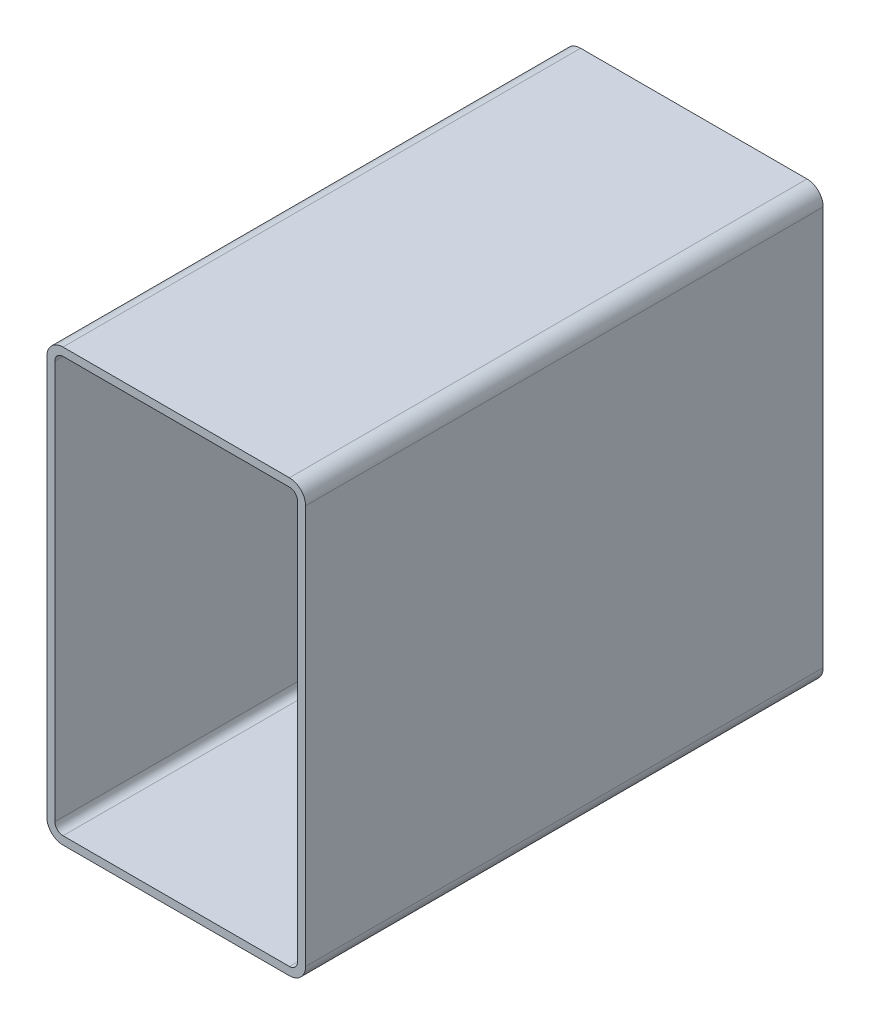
ISO-10303-21;
HEADER;
FILE_DESCRIPTION(('STEP AP214'),'2;1');
FILE_NAME('part.step','',(''),(''),'','','');
FILE_SCHEMA(('AUTOMOTIVE_DESIGN { 1 0 10303 214 1 1 1 1 }'));
ENDSEC;
DATA;
#1=APPLICATION_CONTEXT('core data for automotive mechanical design processes');
#2=APPLICATION_PROTOCOL_DEFINITION('international standard','automotive_design',2000,#1);
#3=PRODUCT_CONTEXT('',#1,'mechanical');
#4=PRODUCT('Part','Part','',(#3));
#5=PRODUCT_RELATED_PRODUCT_CATEGORY('part','',(#4));
#6=PRODUCT_DEFINITION_FORMATION('','',#4);
#7=PRODUCT_DEFINITION_CONTEXT('part definition',#1,'design');
#8=PRODUCT_DEFINITION('design','',#6,#7);
#9=PRODUCT_DEFINITION_SHAPE('','',#8);
#10=(LENGTH_UNIT() NAMED_UNIT(*) SI_UNIT(.MILLI.,.METRE.));
#11=(NAMED_UNIT(*) PLANE_ANGLE_UNIT() SI_UNIT($,.RADIAN.));
#12=(NAMED_UNIT(*) SI_UNIT($,.STERADIAN.) SOLID_ANGLE_UNIT());
#13=UNCERTAINTY_MEASURE_WITH_UNIT(LENGTH_MEASURE(1.E-05),#10,'distance_accuracy_value','');
#14=(GEOMETRIC_REPRESENTATION_CONTEXT(3) GLOBAL_UNCERTAINTY_ASSIGNED_CONTEXT((#13)) GLOBAL_UNIT_ASSIGNED_CONTEXT((#10,
#11,#12)) REPRESENTATION_CONTEXT('',''));
#15=CARTESIAN_POINT('',(0.,0.,0.));
#16=DIRECTION('',(0.,0.,1.));
#17=DIRECTION('',(1.,0.,0.));
#18=AXIS2_PLACEMENT_3D('',#15,#16,#17);
#19=CARTESIAN_POINT('',(9.57230139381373,246.395313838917,304.8));
#20=DIRECTION('',(0.,0.,1.));
#21=DIRECTION('',(1.,0.,0.));
#22=AXIS2_PLACEMENT_3D('',#19,#20,#21);
#23=PLANE('',#22);
#24=CARTESIAN_POINT('',(9.57230139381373,246.395313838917,304.8));
#25=DIRECTION('',(0.,0.,1.));
#26=DIRECTION('',(1.,0.,0.));
#27=AXIS2_PLACEMENT_3D('',#24,#25,#26);
#28=CIRCLE('',#27,9.52500000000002);
#29=CARTESIAN_POINT('',(9.57230139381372,255.920313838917,304.8));
#30=VERTEX_POINT('',#29);
#31=CARTESIAN_POINT('',(0.0473013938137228,246.395313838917,304.8));
#32=VERTEX_POINT('',#31);
#33=EDGE_CURVE('E211',#30,#32,#28,.T.);
#34=ORIENTED_EDGE('',*,*,#33,.T.);
#35=DIRECTION('',(0.,-1.,0.));
#36=VECTOR('',#35,1.);
#37=CARTESIAN_POINT('',(0.0473013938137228,11.4453138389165,304.8));
#38=LINE('',#37,#36);
#39=CARTESIAN_POINT('',(0.0473013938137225,11.4453138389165,304.8));
#40=VERTEX_POINT('',#39);
#41=EDGE_CURVE('E214',#32,#40,#38,.T.);
#42=ORIENTED_EDGE('',*,*,#41,.T.);
#43=CARTESIAN_POINT('',(9.57230139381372,11.4453138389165,304.8));
#44=DIRECTION('',(0.,0.,1.));
#45=DIRECTION('',(1.,0.,0.));
#46=AXIS2_PLACEMENT_3D('',#43,#44,#45);
#47=CIRCLE('',#46,9.525);
#48=CARTESIAN_POINT('',(9.57230139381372,1.92031383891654,304.8));
#49=VERTEX_POINT('',#48);
#50=EDGE_CURVE('E217',#40,#49,#47,.T.);
#51=ORIENTED_EDGE('',*,*,#50,.T.);
#52=DIRECTION('',(1.,0.,0.));
#53=VECTOR('',#52,1.);
#54=CARTESIAN_POINT('',(142.922301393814,1.92031383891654,304.8));
#55=LINE('',#54,#53);
#56=CARTESIAN_POINT('',(142.922301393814,1.92031383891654,304.8));
#57=VERTEX_POINT('',#56);
#58=EDGE_CURVE('E219',#49,#57,#55,.T.);
#59=ORIENTED_EDGE('',*,*,#58,.T.);
#60=CARTESIAN_POINT('',(142.922301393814,11.4453138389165,304.8));
#61=DIRECTION('',(0.,0.,1.));
#62=DIRECTION('',(1.,0.,0.));
#63=AXIS2_PLACEMENT_3D('',#60,#61,#62);
#64=CIRCLE('',#63,9.52500000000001);
#65=CARTESIAN_POINT('',(152.447301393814,11.4453138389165,304.8));
#66=VERTEX_POINT('',#65);
#67=EDGE_CURVE('E221',#57,#66,#64,.T.);
#68=ORIENTED_EDGE('',*,*,#67,.T.);
#69=DIRECTION('',(0.,1.,0.));
#70=VECTOR('',#69,1.);
#71=CARTESIAN_POINT('',(152.447301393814,246.395313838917,304.8));
#72=LINE('',#71,#70);
#73=CARTESIAN_POINT('',(152.447301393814,246.395313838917,304.8));
#74=VERTEX_POINT('',#73);
#75=EDGE_CURVE('E223',#66,#74,#72,.T.);
#76=ORIENTED_EDGE('',*,*,#75,.T.);
#77=CARTESIAN_POINT('',(142.922301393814,246.395313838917,304.8));
#78=DIRECTION('',(0.,0.,1.));
#79=DIRECTION('',(1.,0.,0.));
#80=AXIS2_PLACEMENT_3D('',#77,#78,#79);
#81=CIRCLE('',#80,9.52500000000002);
#82=CARTESIAN_POINT('',(142.922301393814,255.920313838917,304.8));
#83=VERTEX_POINT('',#82);
#84=EDGE_CURVE('E225',#74,#83,#81,.T.);
#85=ORIENTED_EDGE('',*,*,#84,.T.);
#86=DIRECTION('',(-1.,0.,0.));
#87=VECTOR('',#86,1.);
#88=CARTESIAN_POINT('',(9.57230139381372,255.920313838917,304.8));
#89=LINE('',#88,#87);
#90=EDGE_CURVE('E227',#83,#30,#89,.T.);
#91=ORIENTED_EDGE('',*,*,#90,.T.);
#92=EDGE_LOOP('',(#34,#42,#51,#59,#68,#76,#85,#91));
#93=FACE_BOUND('',#92,.T.);
#94=DIRECTION('',(0.,-1.,0.));
#95=VECTOR('',#94,1.);
#96=CARTESIAN_POINT('',(4.80980139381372,11.4453138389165,304.8));
#97=LINE('',#96,#95);
#98=CARTESIAN_POINT('',(4.80980139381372,246.395313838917,304.8));
#99=VERTEX_POINT('',#98);
#100=CARTESIAN_POINT('',(4.80980139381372,11.4453138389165,304.8));
#101=VERTEX_POINT('',#100);
#102=EDGE_CURVE('E154',#99,#101,#97,.T.);
#103=ORIENTED_EDGE('',*,*,#102,.F.);
#104=CARTESIAN_POINT('',(9.57230139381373,246.395313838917,304.8));
#105=DIRECTION('',(0.,0.,1.));
#106=DIRECTION('',(1.,0.,0.));
#107=AXIS2_PLACEMENT_3D('',#104,#105,#106);
#108=CIRCLE('',#107,4.76250000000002);
#109=CARTESIAN_POINT('',(9.57230139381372,251.157813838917,304.8));
#110=VERTEX_POINT('',#109);
#111=EDGE_CURVE('E146',#110,#99,#108,.T.);
#112=ORIENTED_EDGE('',*,*,#111,.F.);
#113=DIRECTION('',(-1.,0.,0.));
#114=VECTOR('',#113,1.);
#115=CARTESIAN_POINT('',(9.57230139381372,251.157813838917,304.8));
#116=LINE('',#115,#114);
#117=CARTESIAN_POINT('',(142.922301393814,251.157813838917,304.8));
#118=VERTEX_POINT('',#117);
#119=EDGE_CURVE('E179',#118,#110,#116,.T.);
#120=ORIENTED_EDGE('',*,*,#119,.F.);
#121=CARTESIAN_POINT('',(142.922301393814,246.395313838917,304.8));
#122=DIRECTION('',(0.,0.,1.));
#123=DIRECTION('',(1.,0.,0.));
#124=AXIS2_PLACEMENT_3D('',#121,#122,#123);
#125=CIRCLE('',#124,4.76250000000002);
#126=CARTESIAN_POINT('',(147.684801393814,246.395313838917,304.8));
#127=VERTEX_POINT('',#126);
#128=EDGE_CURVE('E177',#127,#118,#125,.T.);
#129=ORIENTED_EDGE('',*,*,#128,.F.);
#130=DIRECTION('',(0.,1.,0.));
#131=VECTOR('',#130,1.);
#132=CARTESIAN_POINT('',(147.684801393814,246.395313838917,304.8));
#133=LINE('',#132,#131);
#134=CARTESIAN_POINT('',(147.684801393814,11.4453138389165,304.8));
#135=VERTEX_POINT('',#134);
#136=EDGE_CURVE('E175',#135,#127,#133,.T.);
#137=ORIENTED_EDGE('',*,*,#136,.F.);
#138=CARTESIAN_POINT('',(142.922301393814,11.4453138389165,304.8));
#139=DIRECTION('',(0.,0.,1.));
#140=DIRECTION('',(1.,0.,0.));
#141=AXIS2_PLACEMENT_3D('',#138,#139,#140);
#142=CIRCLE('',#141,4.7625);
#143=CARTESIAN_POINT('',(142.922301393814,6.68281383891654,304.8));
#144=VERTEX_POINT('',#143);
#145=EDGE_CURVE('E173',#144,#135,#142,.T.);
#146=ORIENTED_EDGE('',*,*,#145,.F.);
#147=DIRECTION('',(1.,0.,0.));
#148=VECTOR('',#147,1.);
#149=CARTESIAN_POINT('',(142.922301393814,6.68281383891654,304.8));
#150=LINE('',#149,#148);
#151=CARTESIAN_POINT('',(9.57230139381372,6.68281383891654,304.8));
#152=VERTEX_POINT('',#151);
#153=EDGE_CURVE('E169',#152,#144,#150,.T.);
#154=ORIENTED_EDGE('',*,*,#153,.F.);
#155=CARTESIAN_POINT('',(9.57230139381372,11.4453138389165,304.8));
#156=DIRECTION('',(0.,0.,1.));
#157=DIRECTION('',(1.,0.,0.));
#158=AXIS2_PLACEMENT_3D('',#155,#156,#157);
#159=CIRCLE('',#158,4.7625);
#160=EDGE_CURVE('E167',#101,#152,#159,.T.);
#161=ORIENTED_EDGE('',*,*,#160,.F.);
#162=EDGE_LOOP('',(#103,#112,#120,#129,#137,#146,#154,#161));
#163=FACE_BOUND('',#162,.T.);
#164=ADVANCED_FACE('F33',(#93,#163),#23,.T.);
#165=CARTESIAN_POINT('',(9.57230139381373,246.395313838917,0.));
#166=DIRECTION('',(0.,0.,1.));
#167=DIRECTION('',(1.,0.,0.));
#168=AXIS2_PLACEMENT_3D('',#165,#166,#167);
#169=PLANE('',#168);
#170=CARTESIAN_POINT('',(9.57230139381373,246.395313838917,0.));
#171=DIRECTION('',(0.,0.,1.));
#172=DIRECTION('',(1.,0.,0.));
#173=AXIS2_PLACEMENT_3D('',#170,#171,#172);
#174=CIRCLE('',#173,9.52500000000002);
#175=CARTESIAN_POINT('',(9.57230139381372,255.920313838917,0.));
#176=VERTEX_POINT('',#175);
#177=CARTESIAN_POINT('',(0.0473013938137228,246.395313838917,0.));
#178=VERTEX_POINT('',#177);
#179=EDGE_CURVE('E162',#176,#178,#174,.T.);
#180=ORIENTED_EDGE('',*,*,#179,.F.);
#181=DIRECTION('',(-1.,0.,0.));
#182=VECTOR('',#181,1.);
#183=CARTESIAN_POINT('',(9.57230139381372,255.920313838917,0.));
#184=LINE('',#183,#182);
#185=CARTESIAN_POINT('',(142.922301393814,255.920313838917,0.));
#186=VERTEX_POINT('',#185);
#187=EDGE_CURVE('E215',#186,#176,#184,.T.);
#188=ORIENTED_EDGE('',*,*,#187,.F.);
#189=CARTESIAN_POINT('',(142.922301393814,246.395313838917,0.));
#190=DIRECTION('',(0.,0.,1.));
#191=DIRECTION('',(1.,0.,0.));
#192=AXIS2_PLACEMENT_3D('',#189,#190,#191);
#193=CIRCLE('',#192,9.52500000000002);
#194=CARTESIAN_POINT('',(152.447301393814,246.395313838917,0.));
#195=VERTEX_POINT('',#194);
#196=EDGE_CURVE('E242',#195,#186,#193,.T.);
#197=ORIENTED_EDGE('',*,*,#196,.F.);
#198=DIRECTION('',(0.,1.,0.));
#199=VECTOR('',#198,1.);
#200=CARTESIAN_POINT('',(152.447301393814,246.395313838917,0.));
#201=LINE('',#200,#199);
#202=CARTESIAN_POINT('',(152.447301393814,11.4453138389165,0.));
#203=VERTEX_POINT('',#202);
#204=EDGE_CURVE('E240',#203,#195,#201,.T.);
#205=ORIENTED_EDGE('',*,*,#204,.F.);
#206=CARTESIAN_POINT('',(142.922301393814,11.4453138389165,0.));
#207=DIRECTION('',(0.,0.,1.));
#208=DIRECTION('',(1.,0.,0.));
#209=AXIS2_PLACEMENT_3D('',#206,#207,#208);
#210=CIRCLE('',#209,9.52500000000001);
#211=CARTESIAN_POINT('',(142.922301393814,1.92031383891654,0.));
#212=VERTEX_POINT('',#211);
#213=EDGE_CURVE('E238',#212,#203,#210,.T.);
#214=ORIENTED_EDGE('',*,*,#213,.F.);
#215=DIRECTION('',(1.,0.,0.));
#216=VECTOR('',#215,1.);
#217=CARTESIAN_POINT('',(142.922301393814,1.92031383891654,0.));
#218=LINE('',#217,#216);
#219=CARTESIAN_POINT('',(9.57230139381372,1.92031383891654,0.));
#220=VERTEX_POINT('',#219);
#221=EDGE_CURVE('E236',#220,#212,#218,.T.);
#222=ORIENTED_EDGE('',*,*,#221,.F.);
#223=CARTESIAN_POINT('',(9.57230139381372,11.4453138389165,0.));
#224=DIRECTION('',(0.,0.,1.));
#225=DIRECTION('',(1.,0.,0.));
#226=AXIS2_PLACEMENT_3D('',#223,#224,#225);
#227=CIRCLE('',#226,9.525);
#228=CARTESIAN_POINT('',(0.0473013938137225,11.4453138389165,0.));
#229=VERTEX_POINT('',#228);
#230=EDGE_CURVE('E234',#229,#220,#227,.T.);
#231=ORIENTED_EDGE('',*,*,#230,.F.);
#232=DIRECTION('',(0.,-1.,0.));
#233=VECTOR('',#232,1.);
#234=CARTESIAN_POINT('',(0.0473013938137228,11.4453138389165,0.));
#235=LINE('',#234,#233);
#236=EDGE_CURVE('E232',#178,#229,#235,.T.);
#237=ORIENTED_EDGE('',*,*,#236,.F.);
#238=EDGE_LOOP('',(#180,#188,#197,#205,#214,#222,#231,#237));
#239=FACE_BOUND('',#238,.T.);
#240=CARTESIAN_POINT('',(9.57230139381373,246.395313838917,0.));
#241=DIRECTION('',(0.,0.,1.));
#242=DIRECTION('',(1.,0.,0.));
#243=AXIS2_PLACEMENT_3D('',#240,#241,#242);
#244=CIRCLE('',#243,4.76250000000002);
#245=CARTESIAN_POINT('',(9.57230139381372,251.157813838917,0.));
#246=VERTEX_POINT('',#245);
#247=CARTESIAN_POINT('',(4.80980139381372,246.395313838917,0.));
#248=VERTEX_POINT('',#247);
#249=EDGE_CURVE('E56',#246,#248,#244,.T.);
#250=ORIENTED_EDGE('',*,*,#249,.T.);
#251=DIRECTION('',(0.,-1.,0.));
#252=VECTOR('',#251,1.);
#253=CARTESIAN_POINT('',(4.80980139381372,11.4453138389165,0.));
#254=LINE('',#253,#252);
#255=CARTESIAN_POINT('',(4.80980139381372,11.4453138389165,0.));
#256=VERTEX_POINT('',#255);
#257=EDGE_CURVE('E161',#248,#256,#254,.T.);
#258=ORIENTED_EDGE('',*,*,#257,.T.);
#259=CARTESIAN_POINT('',(9.57230139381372,11.4453138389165,0.));
#260=DIRECTION('',(0.,0.,1.));
#261=DIRECTION('',(1.,0.,0.));
#262=AXIS2_PLACEMENT_3D('',#259,#260,#261);
#263=CIRCLE('',#262,4.7625);
#264=CARTESIAN_POINT('',(9.57230139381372,6.68281383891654,0.));
#265=VERTEX_POINT('',#264);
#266=EDGE_CURVE('E183',#256,#265,#263,.T.);
#267=ORIENTED_EDGE('',*,*,#266,.T.);
#268=DIRECTION('',(1.,0.,0.));
#269=VECTOR('',#268,1.);
#270=CARTESIAN_POINT('',(142.922301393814,6.68281383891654,0.));
#271=LINE('',#270,#269);
#272=CARTESIAN_POINT('',(142.922301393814,6.68281383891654,0.));
#273=VERTEX_POINT('',#272);
#274=EDGE_CURVE('E186',#265,#273,#271,.T.);
#275=ORIENTED_EDGE('',*,*,#274,.T.);
#276=CARTESIAN_POINT('',(142.922301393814,11.4453138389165,0.));
#277=DIRECTION('',(0.,0.,1.));
#278=DIRECTION('',(1.,0.,0.));
#279=AXIS2_PLACEMENT_3D('',#276,#277,#278);
#280=CIRCLE('',#279,4.7625);
#281=CARTESIAN_POINT('',(147.684801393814,11.4453138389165,0.));
#282=VERTEX_POINT('',#281);
#283=EDGE_CURVE('E189',#273,#282,#280,.T.);
#284=ORIENTED_EDGE('',*,*,#283,.T.);
#285=DIRECTION('',(0.,1.,0.));
#286=VECTOR('',#285,1.);
#287=CARTESIAN_POINT('',(147.684801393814,246.395313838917,0.));
#288=LINE('',#287,#286);
#289=CARTESIAN_POINT('',(147.684801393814,246.395313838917,0.));
#290=VERTEX_POINT('',#289);
#291=EDGE_CURVE('E192',#282,#290,#288,.T.);
#292=ORIENTED_EDGE('',*,*,#291,.T.);
#293=CARTESIAN_POINT('',(142.922301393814,246.395313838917,0.));
#294=DIRECTION('',(0.,0.,1.));
#295=DIRECTION('',(1.,0.,0.));
#296=AXIS2_PLACEMENT_3D('',#293,#294,#295);
#297=CIRCLE('',#296,4.76250000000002);
#298=CARTESIAN_POINT('',(142.922301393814,251.157813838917,0.));
#299=VERTEX_POINT('',#298);
#300=EDGE_CURVE('E195',#290,#299,#297,.T.);
#301=ORIENTED_EDGE('',*,*,#300,.T.);
#302=DIRECTION('',(-1.,0.,0.));
#303=VECTOR('',#302,1.);
#304=CARTESIAN_POINT('',(9.57230139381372,251.157813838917,0.));
#305=LINE('',#304,#303);
#306=EDGE_CURVE('E155',#299,#246,#305,.T.);
#307=ORIENTED_EDGE('',*,*,#306,.T.);
#308=EDGE_LOOP('',(#250,#258,#267,#275,#284,#292,#301,#307));
#309=FACE_BOUND('',#308,.T.);
#310=ADVANCED_FACE('F272',(#239,#309),#169,.F.);
#311=CARTESIAN_POINT('',(9.57230139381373,246.395313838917,304.8));
#312=DIRECTION('',(0.,0.,-1.));
#313=DIRECTION('',(-1.,0.,0.));
#314=AXIS2_PLACEMENT_3D('',#311,#312,#313);
#315=CYLINDRICAL_SURFACE('',#314,9.52500000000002);
#316=ORIENTED_EDGE('',*,*,#179,.T.);
#317=DIRECTION('',(0.,0.,-1.));
#318=VECTOR('',#317,1.);
#319=CARTESIAN_POINT('',(0.0473013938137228,246.395313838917,304.8));
#320=LINE('',#319,#318);
#321=EDGE_CURVE('E11',#32,#178,#320,.T.);
#322=ORIENTED_EDGE('',*,*,#321,.F.);
#323=ORIENTED_EDGE('',*,*,#33,.F.);
#324=DIRECTION('',(0.,0.,-1.));
#325=VECTOR('',#324,1.);
#326=CARTESIAN_POINT('',(9.57230139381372,255.920313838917,304.8));
#327=LINE('',#326,#325);
#328=EDGE_CURVE('E229',#30,#176,#327,.T.);
#329=ORIENTED_EDGE('',*,*,#328,.T.);
#330=EDGE_LOOP('',(#316,#322,#323,#329));
#331=FACE_BOUND('',#330,.T.);
#332=ADVANCED_FACE('F35',(#331),#315,.T.);
#333=CARTESIAN_POINT('',(0.0473013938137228,11.4453138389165,304.8));
#334=DIRECTION('',(1.,0.,0.));
#335=DIRECTION('',(0.,0.,-1.));
#336=AXIS2_PLACEMENT_3D('',#333,#334,#335);
#337=PLANE('',#336);
#338=ORIENTED_EDGE('',*,*,#236,.T.);
#339=DIRECTION('',(0.,0.,-1.));
#340=VECTOR('',#339,1.);
#341=CARTESIAN_POINT('',(0.0473013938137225,11.4453138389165,304.8));
#342=LINE('',#341,#340);
#343=EDGE_CURVE('E41',#40,#229,#342,.T.);
#344=ORIENTED_EDGE('',*,*,#343,.F.);
#345=ORIENTED_EDGE('',*,*,#41,.F.);
#346=ORIENTED_EDGE('',*,*,#321,.T.);
#347=EDGE_LOOP('',(#338,#344,#345,#346));
#348=FACE_BOUND('',#347,.T.);
#349=ADVANCED_FACE('F289',(#348),#337,.F.);
#350=CARTESIAN_POINT('',(9.57230139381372,11.4453138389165,304.8));
#351=DIRECTION('',(0.,0.,-1.));
#352=DIRECTION('',(-1.,0.,0.));
#353=AXIS2_PLACEMENT_3D('',#350,#351,#352);
#354=CYLINDRICAL_SURFACE('',#353,9.525);
#355=ORIENTED_EDGE('',*,*,#230,.T.);
#356=DIRECTION('',(0.,0.,-1.));
#357=VECTOR('',#356,1.);
#358=CARTESIAN_POINT('',(9.57230139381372,1.92031383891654,304.8));
#359=LINE('',#358,#357);
#360=EDGE_CURVE('E259',#49,#220,#359,.T.);
#361=ORIENTED_EDGE('',*,*,#360,.F.);
#362=ORIENTED_EDGE('',*,*,#50,.F.);
#363=ORIENTED_EDGE('',*,*,#343,.T.);
#364=EDGE_LOOP('',(#355,#361,#362,#363));
#365=FACE_BOUND('',#364,.T.);
#366=ADVANCED_FACE('F266',(#365),#354,.T.);
#367=CARTESIAN_POINT('',(142.922301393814,1.92031383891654,304.8));
#368=DIRECTION('',(0.,1.,0.));
#369=DIRECTION('',(0.,0.,1.));
#370=AXIS2_PLACEMENT_3D('',#367,#368,#369);
#371=PLANE('',#370);
#372=ORIENTED_EDGE('',*,*,#221,.T.);
#373=DIRECTION('',(0.,0.,-1.));
#374=VECTOR('',#373,1.);
#375=CARTESIAN_POINT('',(142.922301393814,1.92031383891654,304.8));
#376=LINE('',#375,#374);
#377=EDGE_CURVE('E256',#57,#212,#376,.T.);
#378=ORIENTED_EDGE('',*,*,#377,.F.);
#379=ORIENTED_EDGE('',*,*,#58,.F.);
#380=ORIENTED_EDGE('',*,*,#360,.T.);
#381=EDGE_LOOP('',(#372,#378,#379,#380));
#382=FACE_BOUND('',#381,.T.);
#383=ADVANCED_FACE('F278',(#382),#371,.F.);
#384=CARTESIAN_POINT('',(142.922301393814,11.4453138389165,304.8));
#385=DIRECTION('',(0.,0.,-1.));
#386=DIRECTION('',(-1.,0.,0.));
#387=AXIS2_PLACEMENT_3D('',#384,#385,#386);
#388=CYLINDRICAL_SURFACE('',#387,9.52500000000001);
#389=ORIENTED_EDGE('',*,*,#213,.T.);
#390=DIRECTION('',(0.,0.,-1.));
#391=VECTOR('',#390,1.);
#392=CARTESIAN_POINT('',(152.447301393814,11.4453138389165,304.8));
#393=LINE('',#392,#391);
#394=EDGE_CURVE('E253',#66,#203,#393,.T.);
#395=ORIENTED_EDGE('',*,*,#394,.F.);
#396=ORIENTED_EDGE('',*,*,#67,.F.);
#397=ORIENTED_EDGE('',*,*,#377,.T.);
#398=EDGE_LOOP('',(#389,#395,#396,#397));
#399=FACE_BOUND('',#398,.T.);
#400=ADVANCED_FACE('F282',(#399),#388,.T.);
#401=CARTESIAN_POINT('',(152.447301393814,246.395313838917,304.8));
#402=DIRECTION('',(-1.,0.,0.));
#403=DIRECTION('',(0.,0.,1.));
#404=AXIS2_PLACEMENT_3D('',#401,#402,#403);
#405=PLANE('',#404);
#406=ORIENTED_EDGE('',*,*,#204,.T.);
#407=DIRECTION('',(0.,0.,-1.));
#408=VECTOR('',#407,1.);
#409=CARTESIAN_POINT('',(152.447301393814,246.395313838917,304.8));
#410=LINE('',#409,#408);
#411=EDGE_CURVE('E250',#74,#195,#410,.T.);
#412=ORIENTED_EDGE('',*,*,#411,.F.);
#413=ORIENTED_EDGE('',*,*,#75,.F.);
#414=ORIENTED_EDGE('',*,*,#394,.T.);
#415=EDGE_LOOP('',(#406,#412,#413,#414));
#416=FACE_BOUND('',#415,.T.);
#417=ADVANCED_FACE('F302',(#416),#405,.F.);
#418=CARTESIAN_POINT('',(142.922301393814,246.395313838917,304.8));
#419=DIRECTION('',(0.,0.,-1.));
#420=DIRECTION('',(-1.,0.,0.));
#421=AXIS2_PLACEMENT_3D('',#418,#419,#420);
#422=CYLINDRICAL_SURFACE('',#421,9.52500000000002);
#423=ORIENTED_EDGE('',*,*,#196,.T.);
#424=DIRECTION('',(0.,0.,-1.));
#425=VECTOR('',#424,1.);
#426=CARTESIAN_POINT('',(142.922301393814,255.920313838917,304.8));
#427=LINE('',#426,#425);
#428=EDGE_CURVE('E247',#83,#186,#427,.T.);
#429=ORIENTED_EDGE('',*,*,#428,.F.);
#430=ORIENTED_EDGE('',*,*,#84,.F.);
#431=ORIENTED_EDGE('',*,*,#411,.T.);
#432=EDGE_LOOP('',(#423,#429,#430,#431));
#433=FACE_BOUND('',#432,.T.);
#434=ADVANCED_FACE('F300',(#433),#422,.T.);
#435=CARTESIAN_POINT('',(9.57230139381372,255.920313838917,304.8));
#436=DIRECTION('',(0.,-1.,0.));
#437=DIRECTION('',(0.,0.,-1.));
#438=AXIS2_PLACEMENT_3D('',#435,#436,#437);
#439=PLANE('',#438);
#440=ORIENTED_EDGE('',*,*,#187,.T.);
#441=ORIENTED_EDGE('',*,*,#328,.F.);
#442=ORIENTED_EDGE('',*,*,#90,.F.);
#443=ORIENTED_EDGE('',*,*,#428,.T.);
#444=EDGE_LOOP('',(#440,#441,#442,#443));
#445=FACE_BOUND('',#444,.T.);
#446=ADVANCED_FACE('F295',(#445),#439,.F.);
#447=CARTESIAN_POINT('',(9.57230139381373,246.395313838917,304.8));
#448=DIRECTION('',(0.,0.,-1.));
#449=DIRECTION('',(-1.,0.,0.));
#450=AXIS2_PLACEMENT_3D('',#447,#448,#449);
#451=CYLINDRICAL_SURFACE('',#450,4.76250000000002);
#452=ORIENTED_EDGE('',*,*,#249,.F.);
#453=DIRECTION('',(0.,0.,-1.));
#454=VECTOR('',#453,1.);
#455=CARTESIAN_POINT('',(9.57230139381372,251.157813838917,304.8));
#456=LINE('',#455,#454);
#457=EDGE_CURVE('E150',#110,#246,#456,.T.);
#458=ORIENTED_EDGE('',*,*,#457,.F.);
#459=ORIENTED_EDGE('',*,*,#111,.T.);
#460=DIRECTION('',(0.,0.,-1.));
#461=VECTOR('',#460,1.);
#462=CARTESIAN_POINT('',(4.80980139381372,246.395313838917,304.8));
#463=LINE('',#462,#461);
#464=EDGE_CURVE('E149',#99,#248,#463,.T.);
#465=ORIENTED_EDGE('',*,*,#464,.T.);
#466=EDGE_LOOP('',(#452,#458,#459,#465));
#467=FACE_BOUND('',#466,.T.);
#468=ADVANCED_FACE('F148',(#467),#451,.F.);
#469=CARTESIAN_POINT('',(4.80980139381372,11.4453138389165,304.8));
#470=DIRECTION('',(1.,0.,0.));
#471=DIRECTION('',(0.,0.,-1.));
#472=AXIS2_PLACEMENT_3D('',#469,#470,#471);
#473=PLANE('',#472);
#474=ORIENTED_EDGE('',*,*,#257,.F.);
#475=ORIENTED_EDGE('',*,*,#464,.F.);
#476=ORIENTED_EDGE('',*,*,#102,.T.);
#477=DIRECTION('',(0.,0.,-1.));
#478=VECTOR('',#477,1.);
#479=CARTESIAN_POINT('',(4.80980139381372,11.4453138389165,304.8));
#480=LINE('',#479,#478);
#481=EDGE_CURVE('E163',#101,#256,#480,.T.);
#482=ORIENTED_EDGE('',*,*,#481,.T.);
#483=EDGE_LOOP('',(#474,#475,#476,#482));
#484=FACE_BOUND('',#483,.T.);
#485=ADVANCED_FACE('F158',(#484),#473,.T.);
#486=CARTESIAN_POINT('',(9.57230139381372,11.4453138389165,304.8));
#487=DIRECTION('',(0.,0.,-1.));
#488=DIRECTION('',(-1.,0.,0.));
#489=AXIS2_PLACEMENT_3D('',#486,#487,#488);
#490=CYLINDRICAL_SURFACE('',#489,4.7625);
#491=ORIENTED_EDGE('',*,*,#266,.F.);
#492=ORIENTED_EDGE('',*,*,#481,.F.);
#493=ORIENTED_EDGE('',*,*,#160,.T.);
#494=DIRECTION('',(0.,0.,-1.));
#495=VECTOR('',#494,1.);
#496=CARTESIAN_POINT('',(9.57230139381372,6.68281383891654,304.8));
#497=LINE('',#496,#495);
#498=EDGE_CURVE('E208',#152,#265,#497,.T.);
#499=ORIENTED_EDGE('',*,*,#498,.T.);
#500=EDGE_LOOP('',(#491,#492,#493,#499));
#501=FACE_BOUND('',#500,.T.);
#502=ADVANCED_FACE('F327',(#501),#490,.F.);
#503=CARTESIAN_POINT('',(142.922301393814,6.68281383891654,304.8));
#504=DIRECTION('',(0.,1.,0.));
#505=DIRECTION('',(0.,0.,1.));
#506=AXIS2_PLACEMENT_3D('',#503,#504,#505);
#507=PLANE('',#506);
#508=ORIENTED_EDGE('',*,*,#274,.F.);
#509=ORIENTED_EDGE('',*,*,#498,.F.);
#510=ORIENTED_EDGE('',*,*,#153,.T.);
#511=DIRECTION('',(0.,0.,-1.));
#512=VECTOR('',#511,1.);
#513=CARTESIAN_POINT('',(142.922301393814,6.68281383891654,304.8));
#514=LINE('',#513,#512);
#515=EDGE_CURVE('E206',#144,#273,#514,.T.);
#516=ORIENTED_EDGE('',*,*,#515,.T.);
#517=EDGE_LOOP('',(#508,#509,#510,#516));
#518=FACE_BOUND('',#517,.T.);
#519=ADVANCED_FACE('F331',(#518),#507,.T.);
#520=CARTESIAN_POINT('',(142.922301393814,11.4453138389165,304.8));
#521=DIRECTION('',(0.,0.,-1.));
#522=DIRECTION('',(-1.,0.,0.));
#523=AXIS2_PLACEMENT_3D('',#520,#521,#522);
#524=CYLINDRICAL_SURFACE('',#523,4.7625);
#525=ORIENTED_EDGE('',*,*,#283,.F.);
#526=ORIENTED_EDGE('',*,*,#515,.F.);
#527=ORIENTED_EDGE('',*,*,#145,.T.);
#528=DIRECTION('',(0.,0.,-1.));
#529=VECTOR('',#528,1.);
#530=CARTESIAN_POINT('',(147.684801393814,11.4453138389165,304.8));
#531=LINE('',#530,#529);
#532=EDGE_CURVE('E204',#135,#282,#531,.T.);
#533=ORIENTED_EDGE('',*,*,#532,.T.);
#534=EDGE_LOOP('',(#525,#526,#527,#533));
#535=FACE_BOUND('',#534,.T.);
#536=ADVANCED_FACE('F337',(#535),#524,.F.);
#537=CARTESIAN_POINT('',(147.684801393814,246.395313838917,304.8));
#538=DIRECTION('',(-1.,0.,0.));
#539=DIRECTION('',(0.,0.,1.));
#540=AXIS2_PLACEMENT_3D('',#537,#538,#539);
#541=PLANE('',#540);
#542=ORIENTED_EDGE('',*,*,#291,.F.);
#543=ORIENTED_EDGE('',*,*,#532,.F.);
#544=ORIENTED_EDGE('',*,*,#136,.T.);
#545=DIRECTION('',(0.,0.,-1.));
#546=VECTOR('',#545,1.);
#547=CARTESIAN_POINT('',(147.684801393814,246.395313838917,304.8));
#548=LINE('',#547,#546);
#549=EDGE_CURVE('E202',#127,#290,#548,.T.);
#550=ORIENTED_EDGE('',*,*,#549,.T.);
#551=EDGE_LOOP('',(#542,#543,#544,#550));
#552=FACE_BOUND('',#551,.T.);
#553=ADVANCED_FACE('F341',(#552),#541,.T.);
#554=CARTESIAN_POINT('',(142.922301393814,246.395313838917,304.8));
#555=DIRECTION('',(0.,0.,-1.));
#556=DIRECTION('',(-1.,0.,0.));
#557=AXIS2_PLACEMENT_3D('',#554,#555,#556);
#558=CYLINDRICAL_SURFACE('',#557,4.76250000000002);
#559=ORIENTED_EDGE('',*,*,#300,.F.);
#560=ORIENTED_EDGE('',*,*,#549,.F.);
#561=ORIENTED_EDGE('',*,*,#128,.T.);
#562=DIRECTION('',(0.,0.,-1.));
#563=VECTOR('',#562,1.);
#564=CARTESIAN_POINT('',(142.922301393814,251.157813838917,304.8));
#565=LINE('',#564,#563);
#566=EDGE_CURVE('E48',#118,#299,#565,.T.);
#567=ORIENTED_EDGE('',*,*,#566,.T.);
#568=EDGE_LOOP('',(#559,#560,#561,#567));
#569=FACE_BOUND('',#568,.T.);
#570=ADVANCED_FACE('F345',(#569),#558,.F.);
#571=CARTESIAN_POINT('',(9.57230139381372,251.157813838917,304.8));
#572=DIRECTION('',(0.,-1.,0.));
#573=DIRECTION('',(0.,0.,-1.));
#574=AXIS2_PLACEMENT_3D('',#571,#572,#573);
#575=PLANE('',#574);
#576=ORIENTED_EDGE('',*,*,#306,.F.);
#577=ORIENTED_EDGE('',*,*,#566,.F.);
#578=ORIENTED_EDGE('',*,*,#119,.T.);
#579=ORIENTED_EDGE('',*,*,#457,.T.);
#580=EDGE_LOOP('',(#576,#577,#578,#579));
#581=FACE_BOUND('',#580,.T.);
#582=ADVANCED_FACE('F349',(#581),#575,.T.);
#583=CLOSED_SHELL('',(#164,#310,#332,#349,#366,#383,#400,#417,#434,#446,#468,#485,#502,#519,
#536,#553,#570,#582));
#584=MANIFOLD_SOLID_BREP('B2',#583);
#585=ADVANCED_BREP_SHAPE_REPRESENTATION('',(#18,#584),#14);
#586=SHAPE_DEFINITION_REPRESENTATION(#9,#585);
ENDSEC;
END-ISO-10303-21;
